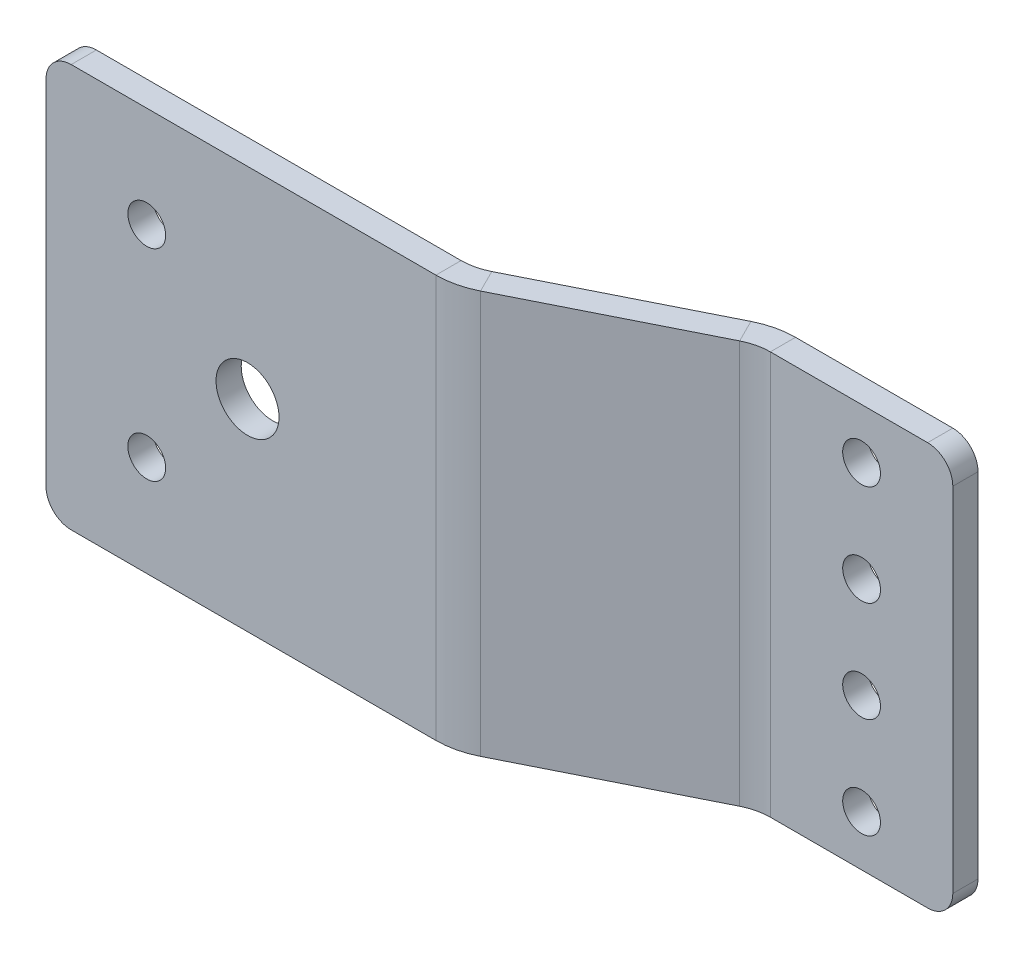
ISO-10303-21;
HEADER;
FILE_DESCRIPTION(('STEP AP214'),'2;1');
FILE_NAME('part.step','',(''),(''),'','','');
FILE_SCHEMA(('AUTOMOTIVE_DESIGN { 1 0 10303 214 1 1 1 1 }'));
ENDSEC;
DATA;
#1=APPLICATION_CONTEXT('core data for automotive mechanical design processes');
#2=APPLICATION_PROTOCOL_DEFINITION('international standard','automotive_design',2000,#1);
#3=PRODUCT_CONTEXT('',#1,'mechanical');
#4=PRODUCT('Part','Part','',(#3));
#5=PRODUCT_RELATED_PRODUCT_CATEGORY('part','',(#4));
#6=PRODUCT_DEFINITION_FORMATION('','',#4);
#7=PRODUCT_DEFINITION_CONTEXT('part definition',#1,'design');
#8=PRODUCT_DEFINITION('design','',#6,#7);
#9=PRODUCT_DEFINITION_SHAPE('','',#8);
#10=(LENGTH_UNIT() NAMED_UNIT(*) SI_UNIT(.MILLI.,.METRE.));
#11=(NAMED_UNIT(*) PLANE_ANGLE_UNIT() SI_UNIT($,.RADIAN.));
#12=(NAMED_UNIT(*) SI_UNIT($,.STERADIAN.) SOLID_ANGLE_UNIT());
#13=UNCERTAINTY_MEASURE_WITH_UNIT(LENGTH_MEASURE(1.E-05),#10,'distance_accuracy_value','');
#14=(GEOMETRIC_REPRESENTATION_CONTEXT(3) GLOBAL_UNCERTAINTY_ASSIGNED_CONTEXT((#13)) GLOBAL_UNIT_ASSIGNED_CONTEXT((#10,
#11,#12)) REPRESENTATION_CONTEXT('',''));
#15=CARTESIAN_POINT('',(0.,0.,0.));
#16=DIRECTION('',(0.,0.,1.));
#17=DIRECTION('',(1.,0.,0.));
#18=AXIS2_PLACEMENT_3D('',#15,#16,#17);
#19=CARTESIAN_POINT('',(1.47801932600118,50.8,-0.739009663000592));
#20=DIRECTION('',(0.,1.,0.));
#21=DIRECTION('',(0.,0.,1.));
#22=AXIS2_PLACEMENT_3D('',#19,#20,#21);
#23=PLANE('',#22);
#24=DIRECTION('',(0.447213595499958,0.,0.894427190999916));
#25=VECTOR('',#24,1.);
#26=CARTESIAN_POINT('',(1.47801932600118,50.8,-0.739009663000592));
#27=LINE('',#26,#25);
#28=CARTESIAN_POINT('',(1.47801932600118,50.8,-0.739009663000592));
#29=VERTEX_POINT('',#28);
#30=CARTESIAN_POINT('',(2.89792249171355,50.8,2.10079666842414));
#31=VERTEX_POINT('',#30);
#32=EDGE_CURVE('E274',#29,#31,#27,.T.);
#33=ORIENTED_EDGE('',*,*,#32,.F.);
#34=CARTESIAN_POINT('',(-1.65247584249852,50.8,-7.));
#35=DIRECTION('',(0.,-1.,0.));
#36=DIRECTION('',(0.,0.,-1.));
#37=AXIS2_PLACEMENT_3D('',#34,#35,#36);
#38=CIRCLE('',#37,7.);
#39=CARTESIAN_POINT('',(-1.65247584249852,50.8,0.));
#40=VERTEX_POINT('',#39);
#41=EDGE_CURVE('E191',#40,#29,#38,.F.);
#42=ORIENTED_EDGE('',*,*,#41,.F.);
#43=DIRECTION('',(0.,0.,-1.));
#44=VECTOR('',#43,1.);
#45=CARTESIAN_POINT('',(-1.65247584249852,50.8,3.175));
#46=LINE('',#45,#44);
#47=CARTESIAN_POINT('',(-1.65247584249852,50.8,3.175));
#48=VERTEX_POINT('',#47);
#49=EDGE_CURVE('E271',#48,#40,#46,.T.);
#50=ORIENTED_EDGE('',*,*,#49,.F.);
#51=CARTESIAN_POINT('',(-1.65247584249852,50.8,-7.));
#52=DIRECTION('',(0.,1.,0.));
#53=DIRECTION('',(1.,0.,0.));
#54=AXIS2_PLACEMENT_3D('',#51,#52,#53);
#55=CIRCLE('',#54,10.175);
#56=EDGE_CURVE('E201',#48,#31,#55,.T.);
#57=ORIENTED_EDGE('',*,*,#56,.T.);
#58=EDGE_LOOP('',(#33,#42,#50,#57));
#59=FACE_BOUND('',#58,.T.);
#60=ADVANCED_FACE('F36',(#59),#23,.T.);
#61=CARTESIAN_POINT('',(-1.65247584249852,50.8,3.175));
#62=DIRECTION('',(0.,1.,0.));
#63=DIRECTION('',(0.,0.,1.));
#64=AXIS2_PLACEMENT_3D('',#61,#62,#63);
#65=PLANE('',#64);
#66=DIRECTION('',(0.894427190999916,0.,-0.447213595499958));
#67=VECTOR('',#66,1.);
#68=CARTESIAN_POINT('',(0.,50.8,0.));
#69=LINE('',#68,#67);
#70=CARTESIAN_POINT('',(23.2515933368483,50.8,-11.6257966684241));
#71=VERTEX_POINT('',#70);
#72=EDGE_CURVE('E189',#29,#71,#69,.T.);
#73=ORIENTED_EDGE('',*,*,#72,.F.);
#74=ORIENTED_EDGE('',*,*,#32,.T.);
#75=DIRECTION('',(0.894427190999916,0.,-0.447213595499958));
#76=VECTOR('',#75,1.);
#77=CARTESIAN_POINT('',(1.41990316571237,50.8,2.83980633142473));
#78=LINE('',#77,#76);
#79=CARTESIAN_POINT('',(24.6714965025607,50.8,-8.78599033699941));
#80=VERTEX_POINT('',#79);
#81=EDGE_CURVE('E204',#31,#80,#78,.T.);
#82=ORIENTED_EDGE('',*,*,#81,.T.);
#83=DIRECTION('',(-0.447213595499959,0.,-0.894427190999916));
#84=VECTOR('',#83,1.);
#85=CARTESIAN_POINT('',(24.6714965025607,50.8,-8.78599033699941));
#86=LINE('',#85,#84);
#87=EDGE_CURVE('E163',#80,#71,#86,.T.);
#88=ORIENTED_EDGE('',*,*,#87,.T.);
#89=EDGE_LOOP('',(#73,#74,#82,#88));
#90=FACE_BOUND('',#89,.T.);
#91=ADVANCED_FACE('F340',(#90),#65,.T.);
#92=CARTESIAN_POINT('',(-1.65247584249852,0.,0.));
#93=DIRECTION('',(0.,-1.,0.));
#94=DIRECTION('',(0.,0.,-1.));
#95=AXIS2_PLACEMENT_3D('',#92,#93,#94);
#96=PLANE('',#95);
#97=DIRECTION('',(0.,0.,1.));
#98=VECTOR('',#97,1.);
#99=CARTESIAN_POINT('',(-1.65247584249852,0.,0.));
#100=LINE('',#99,#98);
#101=CARTESIAN_POINT('',(-1.65247584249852,0.,0.));
#102=VERTEX_POINT('',#101);
#103=CARTESIAN_POINT('',(-1.65247584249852,0.,3.175));
#104=VERTEX_POINT('',#103);
#105=EDGE_CURVE('E268',#102,#104,#100,.T.);
#106=ORIENTED_EDGE('',*,*,#105,.F.);
#107=CARTESIAN_POINT('',(-1.65247584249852,0.,-7.));
#108=DIRECTION('',(0.,-1.,0.));
#109=DIRECTION('',(0.,0.,-1.));
#110=AXIS2_PLACEMENT_3D('',#107,#108,#109);
#111=CIRCLE('',#110,7.);
#112=CARTESIAN_POINT('',(1.47801932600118,0.,-0.739009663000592));
#113=VERTEX_POINT('',#112);
#114=EDGE_CURVE('E219',#102,#113,#111,.F.);
#115=ORIENTED_EDGE('',*,*,#114,.T.);
#116=DIRECTION('',(-0.447213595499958,0.,-0.894427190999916));
#117=VECTOR('',#116,1.);
#118=CARTESIAN_POINT('',(2.89792249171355,0.,2.10079666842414));
#119=LINE('',#118,#117);
#120=CARTESIAN_POINT('',(2.89792249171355,0.,2.10079666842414));
#121=VERTEX_POINT('',#120);
#122=EDGE_CURVE('E162',#121,#113,#119,.T.);
#123=ORIENTED_EDGE('',*,*,#122,.F.);
#124=CARTESIAN_POINT('',(-1.65247584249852,0.,-7.));
#125=DIRECTION('',(0.,1.,0.));
#126=DIRECTION('',(1.,0.,0.));
#127=AXIS2_PLACEMENT_3D('',#124,#125,#126);
#128=CIRCLE('',#127,10.175);
#129=EDGE_CURVE('E226',#104,#121,#128,.T.);
#130=ORIENTED_EDGE('',*,*,#129,.F.);
#131=EDGE_LOOP('',(#106,#115,#123,#130));
#132=FACE_BOUND('',#131,.T.);
#133=ADVANCED_FACE('F427',(#132),#96,.T.);
#134=CARTESIAN_POINT('',(2.89792249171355,0.,2.10079666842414));
#135=DIRECTION('',(0.,-1.,0.));
#136=DIRECTION('',(0.,0.,-1.));
#137=AXIS2_PLACEMENT_3D('',#134,#135,#136);
#138=PLANE('',#137);
#139=DIRECTION('',(1.,0.,0.));
#140=VECTOR('',#139,1.);
#141=CARTESIAN_POINT('',(-50.8,0.,3.175));
#142=LINE('',#141,#140);
#143=CARTESIAN_POINT('',(-47.625,0.,3.175));
#144=VERTEX_POINT('',#143);
#145=EDGE_CURVE('E224',#144,#104,#142,.T.);
#146=ORIENTED_EDGE('',*,*,#145,.F.);
#147=DIRECTION('',(0.,0.,-1.));
#148=VECTOR('',#147,1.);
#149=CARTESIAN_POINT('',(-47.625,0.,2.10079666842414));
#150=LINE('',#149,#148);
#151=CARTESIAN_POINT('',(-47.625,0.,0.));
#152=VERTEX_POINT('',#151);
#153=EDGE_CURVE('E293',#144,#152,#150,.T.);
#154=ORIENTED_EDGE('',*,*,#153,.T.);
#155=DIRECTION('',(1.,0.,0.));
#156=VECTOR('',#155,1.);
#157=CARTESIAN_POINT('',(-50.8,0.,0.));
#158=LINE('',#157,#156);
#159=EDGE_CURVE('E222',#152,#102,#158,.T.);
#160=ORIENTED_EDGE('',*,*,#159,.T.);
#161=ORIENTED_EDGE('',*,*,#105,.T.);
#162=EDGE_LOOP('',(#146,#154,#160,#161));
#163=FACE_BOUND('',#162,.T.);
#164=ADVANCED_FACE('F313',(#163),#138,.T.);
#165=CARTESIAN_POINT('',(27.8019916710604,50.8,-12.7));
#166=DIRECTION('',(0.,1.,0.));
#167=DIRECTION('',(0.,0.,1.));
#168=AXIS2_PLACEMENT_3D('',#165,#166,#167);
#169=PLANE('',#168);
#170=DIRECTION('',(0.,0.,1.));
#171=VECTOR('',#170,1.);
#172=CARTESIAN_POINT('',(27.8019916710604,50.8,-12.7));
#173=LINE('',#172,#171);
#174=CARTESIAN_POINT('',(27.8019916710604,50.8,-12.7));
#175=VERTEX_POINT('',#174);
#176=CARTESIAN_POINT('',(27.8019916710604,50.8,-9.525));
#177=VERTEX_POINT('',#176);
#178=EDGE_CURVE('E150',#175,#177,#173,.T.);
#179=ORIENTED_EDGE('',*,*,#178,.F.);
#180=CARTESIAN_POINT('',(27.8019916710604,50.8,-2.525));
#181=DIRECTION('',(0.,1.,0.));
#182=DIRECTION('',(0.,0.,1.));
#183=AXIS2_PLACEMENT_3D('',#180,#181,#182);
#184=CIRCLE('',#183,10.175);
#185=EDGE_CURVE('E154',#71,#175,#184,.F.);
#186=ORIENTED_EDGE('',*,*,#185,.F.);
#187=ORIENTED_EDGE('',*,*,#87,.F.);
#188=CARTESIAN_POINT('',(27.8019916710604,50.8,-2.525));
#189=DIRECTION('',(0.,1.,0.));
#190=DIRECTION('',(1.,0.,0.));
#191=AXIS2_PLACEMENT_3D('',#188,#189,#190);
#192=CIRCLE('',#191,7.);
#193=EDGE_CURVE('E157',#80,#177,#192,.F.);
#194=ORIENTED_EDGE('',*,*,#193,.T.);
#195=EDGE_LOOP('',(#179,#186,#187,#194));
#196=FACE_BOUND('',#195,.T.);
#197=ADVANCED_FACE('F152',(#196),#169,.T.);
#198=CARTESIAN_POINT('',(24.6714965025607,50.8,-8.78599033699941));
#199=DIRECTION('',(0.,1.,0.));
#200=DIRECTION('',(0.,0.,1.));
#201=AXIS2_PLACEMENT_3D('',#198,#199,#200);
#202=PLANE('',#201);
#203=DIRECTION('',(1.,0.,0.));
#204=VECTOR('',#203,1.);
#205=CARTESIAN_POINT('',(25.4,50.8,-9.525));
#206=LINE('',#205,#204);
#207=CARTESIAN_POINT('',(47.625,50.8,-9.525));
#208=VERTEX_POINT('',#207);
#209=EDGE_CURVE('E184',#177,#208,#206,.T.);
#210=ORIENTED_EDGE('',*,*,#209,.T.);
#211=DIRECTION('',(0.,0.,1.));
#212=VECTOR('',#211,1.);
#213=CARTESIAN_POINT('',(47.625,50.8,-8.78599033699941));
#214=LINE('',#213,#212);
#215=CARTESIAN_POINT('',(47.625,50.8,-12.7));
#216=VERTEX_POINT('',#215);
#217=EDGE_CURVE('E183',#208,#216,#214,.F.);
#218=ORIENTED_EDGE('',*,*,#217,.T.);
#219=DIRECTION('',(1.,0.,0.));
#220=VECTOR('',#219,1.);
#221=CARTESIAN_POINT('',(25.4,50.8,-12.7));
#222=LINE('',#221,#220);
#223=EDGE_CURVE('E171',#175,#216,#222,.T.);
#224=ORIENTED_EDGE('',*,*,#223,.F.);
#225=ORIENTED_EDGE('',*,*,#178,.T.);
#226=EDGE_LOOP('',(#210,#218,#224,#225));
#227=FACE_BOUND('',#226,.T.);
#228=ADVANCED_FACE('F181',(#227),#202,.T.);
#229=CARTESIAN_POINT('',(23.2515933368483,0.,-11.6257966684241));
#230=DIRECTION('',(0.,-1.,0.));
#231=DIRECTION('',(0.,0.,-1.));
#232=AXIS2_PLACEMENT_3D('',#229,#230,#231);
#233=PLANE('',#232);
#234=DIRECTION('',(0.447213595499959,0.,0.894427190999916));
#235=VECTOR('',#234,1.);
#236=CARTESIAN_POINT('',(23.2515933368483,0.,-11.6257966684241));
#237=LINE('',#236,#235);
#238=CARTESIAN_POINT('',(23.2515933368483,0.,-11.6257966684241));
#239=VERTEX_POINT('',#238);
#240=CARTESIAN_POINT('',(24.6714965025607,0.,-8.78599033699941));
#241=VERTEX_POINT('',#240);
#242=EDGE_CURVE('E264',#239,#241,#237,.T.);
#243=ORIENTED_EDGE('',*,*,#242,.F.);
#244=CARTESIAN_POINT('',(27.8019916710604,0.,-2.525));
#245=DIRECTION('',(0.,1.,0.));
#246=DIRECTION('',(0.,0.,1.));
#247=AXIS2_PLACEMENT_3D('',#244,#245,#246);
#248=CIRCLE('',#247,10.175);
#249=CARTESIAN_POINT('',(27.8019916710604,0.,-12.7));
#250=VERTEX_POINT('',#249);
#251=EDGE_CURVE('E214',#239,#250,#248,.F.);
#252=ORIENTED_EDGE('',*,*,#251,.T.);
#253=DIRECTION('',(0.,0.,-1.));
#254=VECTOR('',#253,1.);
#255=CARTESIAN_POINT('',(27.8019916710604,0.,-9.525));
#256=LINE('',#255,#254);
#257=CARTESIAN_POINT('',(27.8019916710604,0.,-9.525));
#258=VERTEX_POINT('',#257);
#259=EDGE_CURVE('E262',#258,#250,#256,.T.);
#260=ORIENTED_EDGE('',*,*,#259,.F.);
#261=CARTESIAN_POINT('',(27.8019916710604,0.,-2.525));
#262=DIRECTION('',(0.,1.,0.));
#263=DIRECTION('',(1.,0.,0.));
#264=AXIS2_PLACEMENT_3D('',#261,#262,#263);
#265=CIRCLE('',#264,7.);
#266=EDGE_CURVE('E232',#241,#258,#265,.F.);
#267=ORIENTED_EDGE('',*,*,#266,.F.);
#268=EDGE_LOOP('',(#243,#252,#260,#267));
#269=FACE_BOUND('',#268,.T.);
#270=ADVANCED_FACE('F562',(#269),#233,.T.);
#271=CARTESIAN_POINT('',(27.8019916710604,0.,-9.525));
#272=DIRECTION('',(0.,-1.,0.));
#273=DIRECTION('',(0.,0.,-1.));
#274=AXIS2_PLACEMENT_3D('',#271,#272,#273);
#275=PLANE('',#274);
#276=DIRECTION('',(0.894427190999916,0.,-0.447213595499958));
#277=VECTOR('',#276,1.);
#278=CARTESIAN_POINT('',(0.,0.,0.));
#279=LINE('',#278,#277);
#280=EDGE_CURVE('E216',#113,#239,#279,.T.);
#281=ORIENTED_EDGE('',*,*,#280,.T.);
#282=ORIENTED_EDGE('',*,*,#242,.T.);
#283=DIRECTION('',(0.894427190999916,0.,-0.447213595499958));
#284=VECTOR('',#283,1.);
#285=CARTESIAN_POINT('',(1.41990316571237,0.,2.83980633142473));
#286=LINE('',#285,#284);
#287=EDGE_CURVE('E229',#121,#241,#286,.T.);
#288=ORIENTED_EDGE('',*,*,#287,.F.);
#289=ORIENTED_EDGE('',*,*,#122,.T.);
#290=EDGE_LOOP('',(#281,#282,#288,#289));
#291=FACE_BOUND('',#290,.T.);
#292=ADVANCED_FACE('F549',(#291),#275,.T.);
#293=CARTESIAN_POINT('',(25.4,50.8,-9.525));
#294=DIRECTION('',(0.,0.,-1.));
#295=DIRECTION('',(-1.,0.,0.));
#296=AXIS2_PLACEMENT_3D('',#293,#294,#295);
#297=PLANE('',#296);
#298=CARTESIAN_POINT('',(39.3009958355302,6.35,-9.525));
#299=DIRECTION('',(0.,0.,1.));
#300=DIRECTION('',(1.,0.,0.));
#301=AXIS2_PLACEMENT_3D('',#298,#299,#300);
#302=CIRCLE('',#301,2.38125);
#303=CARTESIAN_POINT('',(41.6822458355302,6.35,-9.525));
#304=VERTEX_POINT('',#303);
#305=EDGE_CURVE('E373',#304,#304,#302,.T.);
#306=ORIENTED_EDGE('',*,*,#305,.F.);
#307=EDGE_LOOP('',(#306));
#308=FACE_BOUND('',#307,.T.);
#309=CARTESIAN_POINT('',(39.3009958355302,19.05,-9.525));
#310=DIRECTION('',(0.,0.,1.));
#311=DIRECTION('',(1.,0.,0.));
#312=AXIS2_PLACEMENT_3D('',#309,#310,#311);
#313=CIRCLE('',#312,2.38125);
#314=CARTESIAN_POINT('',(41.6822458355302,19.05,-9.525));
#315=VERTEX_POINT('',#314);
#316=EDGE_CURVE('E367',#315,#315,#313,.T.);
#317=ORIENTED_EDGE('',*,*,#316,.F.);
#318=EDGE_LOOP('',(#317));
#319=FACE_BOUND('',#318,.T.);
#320=CARTESIAN_POINT('',(39.3009958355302,31.75,-9.525));
#321=DIRECTION('',(0.,0.,1.));
#322=DIRECTION('',(1.,0.,0.));
#323=AXIS2_PLACEMENT_3D('',#320,#321,#322);
#324=CIRCLE('',#323,2.38125);
#325=CARTESIAN_POINT('',(41.6822458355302,31.75,-9.525));
#326=VERTEX_POINT('',#325);
#327=EDGE_CURVE('E361',#326,#326,#324,.T.);
#328=ORIENTED_EDGE('',*,*,#327,.F.);
#329=EDGE_LOOP('',(#328));
#330=FACE_BOUND('',#329,.T.);
#331=CARTESIAN_POINT('',(39.3009958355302,44.45,-9.525));
#332=DIRECTION('',(0.,0.,1.));
#333=DIRECTION('',(1.,0.,0.));
#334=AXIS2_PLACEMENT_3D('',#331,#332,#333);
#335=CIRCLE('',#334,2.38125);
#336=CARTESIAN_POINT('',(41.6822458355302,44.45,-9.525));
#337=VERTEX_POINT('',#336);
#338=EDGE_CURVE('E355',#337,#337,#335,.T.);
#339=ORIENTED_EDGE('',*,*,#338,.F.);
#340=EDGE_LOOP('',(#339));
#341=FACE_BOUND('',#340,.T.);
#342=DIRECTION('',(0.,-1.,0.));
#343=VECTOR('',#342,1.);
#344=CARTESIAN_POINT('',(50.8,50.8,-9.525));
#345=LINE('',#344,#343);
#346=CARTESIAN_POINT('',(50.8,47.625,-9.525));
#347=VERTEX_POINT('',#346);
#348=CARTESIAN_POINT('',(50.8,3.175,-9.525));
#349=VERTEX_POINT('',#348);
#350=EDGE_CURVE('E259',#347,#349,#345,.T.);
#351=ORIENTED_EDGE('',*,*,#350,.F.);
#352=CARTESIAN_POINT('',(47.625,47.625,-9.525));
#353=DIRECTION('',(0.,0.,-1.));
#354=DIRECTION('',(-1.,0.,0.));
#355=AXIS2_PLACEMENT_3D('',#352,#353,#354);
#356=CIRCLE('',#355,3.175);
#357=EDGE_CURVE('E283',#347,#208,#356,.F.);
#358=ORIENTED_EDGE('',*,*,#357,.T.);
#359=ORIENTED_EDGE('',*,*,#209,.F.);
#360=DIRECTION('',(0.,-1.,0.));
#361=VECTOR('',#360,1.);
#362=CARTESIAN_POINT('',(27.8019916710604,50.8,-9.525));
#363=LINE('',#362,#361);
#364=EDGE_CURVE('E208',#177,#258,#363,.T.);
#365=ORIENTED_EDGE('',*,*,#364,.T.);
#366=DIRECTION('',(1.,0.,0.));
#367=VECTOR('',#366,1.);
#368=CARTESIAN_POINT('',(25.4,0.,-9.525));
#369=LINE('',#368,#367);
#370=CARTESIAN_POINT('',(47.625,0.,-9.525));
#371=VERTEX_POINT('',#370);
#372=EDGE_CURVE('E209',#258,#371,#369,.T.);
#373=ORIENTED_EDGE('',*,*,#372,.T.);
#374=CARTESIAN_POINT('',(47.625,3.175,-9.525));
#375=DIRECTION('',(0.,0.,-1.));
#376=DIRECTION('',(-1.,0.,0.));
#377=AXIS2_PLACEMENT_3D('',#374,#375,#376);
#378=CIRCLE('',#377,3.175);
#379=EDGE_CURVE('E281',#371,#349,#378,.F.);
#380=ORIENTED_EDGE('',*,*,#379,.T.);
#381=EDGE_LOOP('',(#351,#358,#359,#365,#373,#380));
#382=FACE_BOUND('',#381,.T.);
#383=ADVANCED_FACE('F353',(#308,#319,#330,#341,#382),#297,.F.);
#384=CARTESIAN_POINT('',(50.8,50.8,-12.7));
#385=DIRECTION('',(1.,0.,0.));
#386=DIRECTION('',(0.,0.,-1.));
#387=AXIS2_PLACEMENT_3D('',#384,#385,#386);
#388=PLANE('',#387);
#389=DIRECTION('',(0.,-1.,0.));
#390=VECTOR('',#389,1.);
#391=CARTESIAN_POINT('',(50.8,50.8,-12.7));
#392=LINE('',#391,#390);
#393=CARTESIAN_POINT('',(50.8,47.625,-12.7));
#394=VERTEX_POINT('',#393);
#395=CARTESIAN_POINT('',(50.8,3.175,-12.7));
#396=VERTEX_POINT('',#395);
#397=EDGE_CURVE('E178',#394,#396,#392,.T.);
#398=ORIENTED_EDGE('',*,*,#397,.F.);
#399=DIRECTION('',(0.,0.,1.));
#400=VECTOR('',#399,1.);
#401=CARTESIAN_POINT('',(50.8,47.625,-12.7));
#402=LINE('',#401,#400);
#403=EDGE_CURVE('E278',#394,#347,#402,.T.);
#404=ORIENTED_EDGE('',*,*,#403,.T.);
#405=ORIENTED_EDGE('',*,*,#350,.T.);
#406=DIRECTION('',(0.,0.,1.));
#407=VECTOR('',#406,1.);
#408=CARTESIAN_POINT('',(50.8,3.175,-12.7));
#409=LINE('',#408,#407);
#410=EDGE_CURVE('E276',#349,#396,#409,.F.);
#411=ORIENTED_EDGE('',*,*,#410,.T.);
#412=EDGE_LOOP('',(#398,#404,#405,#411));
#413=FACE_BOUND('',#412,.T.);
#414=ADVANCED_FACE('F526',(#413),#388,.T.);
#415=CARTESIAN_POINT('',(25.4,50.8,-12.7));
#416=DIRECTION('',(0.,0.,-1.));
#417=DIRECTION('',(-1.,0.,0.));
#418=AXIS2_PLACEMENT_3D('',#415,#416,#417);
#419=PLANE('',#418);
#420=CARTESIAN_POINT('',(39.3009958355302,6.35,-12.7));
#421=DIRECTION('',(0.,0.,1.));
#422=DIRECTION('',(1.,0.,0.));
#423=AXIS2_PLACEMENT_3D('',#420,#421,#422);
#424=CIRCLE('',#423,2.38125);
#425=CARTESIAN_POINT('',(41.6822458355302,6.35,-12.7));
#426=VERTEX_POINT('',#425);
#427=EDGE_CURVE('E370',#426,#426,#424,.T.);
#428=ORIENTED_EDGE('',*,*,#427,.T.);
#429=EDGE_LOOP('',(#428));
#430=FACE_BOUND('',#429,.T.);
#431=CARTESIAN_POINT('',(39.3009958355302,19.05,-12.7));
#432=DIRECTION('',(0.,0.,1.));
#433=DIRECTION('',(1.,0.,0.));
#434=AXIS2_PLACEMENT_3D('',#431,#432,#433);
#435=CIRCLE('',#434,2.38125);
#436=CARTESIAN_POINT('',(41.6822458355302,19.05,-12.7));
#437=VERTEX_POINT('',#436);
#438=EDGE_CURVE('E364',#437,#437,#435,.T.);
#439=ORIENTED_EDGE('',*,*,#438,.T.);
#440=EDGE_LOOP('',(#439));
#441=FACE_BOUND('',#440,.T.);
#442=CARTESIAN_POINT('',(39.3009958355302,31.75,-12.7));
#443=DIRECTION('',(0.,0.,1.));
#444=DIRECTION('',(1.,0.,0.));
#445=AXIS2_PLACEMENT_3D('',#442,#443,#444);
#446=CIRCLE('',#445,2.38125);
#447=CARTESIAN_POINT('',(41.6822458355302,31.75,-12.7));
#448=VERTEX_POINT('',#447);
#449=EDGE_CURVE('E358',#448,#448,#446,.T.);
#450=ORIENTED_EDGE('',*,*,#449,.T.);
#451=EDGE_LOOP('',(#450));
#452=FACE_BOUND('',#451,.T.);
#453=CARTESIAN_POINT('',(39.3009958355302,44.45,-12.7));
#454=DIRECTION('',(0.,0.,1.));
#455=DIRECTION('',(1.,0.,0.));
#456=AXIS2_PLACEMENT_3D('',#453,#454,#455);
#457=CIRCLE('',#456,2.38125);
#458=CARTESIAN_POINT('',(41.6822458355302,44.45,-12.7));
#459=VERTEX_POINT('',#458);
#460=EDGE_CURVE('E212',#459,#459,#457,.T.);
#461=ORIENTED_EDGE('',*,*,#460,.T.);
#462=EDGE_LOOP('',(#461));
#463=FACE_BOUND('',#462,.T.);
#464=ORIENTED_EDGE('',*,*,#223,.T.);
#465=CARTESIAN_POINT('',(47.625,47.625,-12.7));
#466=DIRECTION('',(0.,0.,-1.));
#467=DIRECTION('',(-1.,0.,0.));
#468=AXIS2_PLACEMENT_3D('',#465,#466,#467);
#469=CIRCLE('',#468,3.175);
#470=EDGE_CURVE('E288',#216,#394,#469,.T.);
#471=ORIENTED_EDGE('',*,*,#470,.T.);
#472=ORIENTED_EDGE('',*,*,#397,.T.);
#473=CARTESIAN_POINT('',(47.625,3.175,-12.7));
#474=DIRECTION('',(0.,0.,-1.));
#475=DIRECTION('',(-1.,0.,0.));
#476=AXIS2_PLACEMENT_3D('',#473,#474,#475);
#477=CIRCLE('',#476,3.175);
#478=CARTESIAN_POINT('',(47.625,0.,-12.7));
#479=VERTEX_POINT('',#478);
#480=EDGE_CURVE('E286',#396,#479,#477,.T.);
#481=ORIENTED_EDGE('',*,*,#480,.T.);
#482=DIRECTION('',(1.,0.,0.));
#483=VECTOR('',#482,1.);
#484=CARTESIAN_POINT('',(25.4,0.,-12.7));
#485=LINE('',#484,#483);
#486=EDGE_CURVE('E174',#250,#479,#485,.T.);
#487=ORIENTED_EDGE('',*,*,#486,.F.);
#488=DIRECTION('',(0.,-1.,0.));
#489=VECTOR('',#488,1.);
#490=CARTESIAN_POINT('',(27.8019916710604,50.8,-12.7));
#491=LINE('',#490,#489);
#492=EDGE_CURVE('E169',#175,#250,#491,.T.);
#493=ORIENTED_EDGE('',*,*,#492,.F.);
#494=EDGE_LOOP('',(#464,#471,#472,#481,#487,#493));
#495=FACE_BOUND('',#494,.T.);
#496=ADVANCED_FACE('F170',(#430,#441,#452,#463,#495),#419,.T.);
#497=CARTESIAN_POINT('',(27.8019916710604,50.8,-2.525));
#498=DIRECTION('',(0.,-1.,0.));
#499=DIRECTION('',(0.,0.,-1.));
#500=AXIS2_PLACEMENT_3D('',#497,#498,#499);
#501=CYLINDRICAL_SURFACE('',#500,10.175);
#502=ORIENTED_EDGE('',*,*,#251,.F.);
#503=DIRECTION('',(0.,-1.,0.));
#504=VECTOR('',#503,1.);
#505=CARTESIAN_POINT('',(23.2515933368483,50.8,-11.6257966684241));
#506=LINE('',#505,#504);
#507=EDGE_CURVE('E179',#71,#239,#506,.T.);
#508=ORIENTED_EDGE('',*,*,#507,.F.);
#509=ORIENTED_EDGE('',*,*,#185,.T.);
#510=ORIENTED_EDGE('',*,*,#492,.T.);
#511=EDGE_LOOP('',(#502,#508,#509,#510));
#512=FACE_BOUND('',#511,.T.);
#513=ADVANCED_FACE('F187',(#512),#501,.T.);
#514=CARTESIAN_POINT('',(0.,50.8,0.));
#515=DIRECTION('',(-0.447213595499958,0.,-0.894427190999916));
#516=DIRECTION('',(-0.894427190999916,0.,0.447213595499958));
#517=AXIS2_PLACEMENT_3D('',#514,#515,#516);
#518=PLANE('',#517);
#519=ORIENTED_EDGE('',*,*,#280,.F.);
#520=DIRECTION('',(0.,-1.,0.));
#521=VECTOR('',#520,1.);
#522=CARTESIAN_POINT('',(1.47801932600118,50.8,-0.739009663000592));
#523=LINE('',#522,#521);
#524=EDGE_CURVE('E253',#29,#113,#523,.T.);
#525=ORIENTED_EDGE('',*,*,#524,.F.);
#526=ORIENTED_EDGE('',*,*,#72,.T.);
#527=ORIENTED_EDGE('',*,*,#507,.T.);
#528=EDGE_LOOP('',(#519,#525,#526,#527));
#529=FACE_BOUND('',#528,.T.);
#530=ADVANCED_FACE('F339',(#529),#518,.T.);
#531=CARTESIAN_POINT('',(-1.65247584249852,50.8,-7.));
#532=DIRECTION('',(0.,-1.,0.));
#533=DIRECTION('',(0.,0.,-1.));
#534=AXIS2_PLACEMENT_3D('',#531,#532,#533);
#535=CYLINDRICAL_SURFACE('',#534,7.);
#536=ORIENTED_EDGE('',*,*,#114,.F.);
#537=DIRECTION('',(0.,-1.,0.));
#538=VECTOR('',#537,1.);
#539=CARTESIAN_POINT('',(-1.65247584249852,50.8,0.));
#540=LINE('',#539,#538);
#541=EDGE_CURVE('E250',#40,#102,#540,.T.);
#542=ORIENTED_EDGE('',*,*,#541,.F.);
#543=ORIENTED_EDGE('',*,*,#41,.T.);
#544=ORIENTED_EDGE('',*,*,#524,.T.);
#545=EDGE_LOOP('',(#536,#542,#543,#544));
#546=FACE_BOUND('',#545,.T.);
#547=ADVANCED_FACE('F331',(#546),#535,.F.);
#548=CARTESIAN_POINT('',(-50.8,50.8,0.));
#549=DIRECTION('',(0.,0.,-1.));
#550=DIRECTION('',(-1.,0.,0.));
#551=AXIS2_PLACEMENT_3D('',#548,#549,#550);
#552=PLANE('',#551);
#553=CARTESIAN_POINT('',(-25.4,25.4,0.));
#554=DIRECTION('',(0.,0.,-1.));
#555=DIRECTION('',(-1.,0.,0.));
#556=AXIS2_PLACEMENT_3D('',#553,#554,#555);
#557=CIRCLE('',#556,3.96874999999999);
#558=CARTESIAN_POINT('',(-29.36875,25.4,0.));
#559=VERTEX_POINT('',#558);
#560=EDGE_CURVE('E390',#559,#559,#557,.T.);
#561=ORIENTED_EDGE('',*,*,#560,.F.);
#562=EDGE_LOOP('',(#561));
#563=FACE_BOUND('',#562,.T.);
#564=CARTESIAN_POINT('',(-38.1,12.7,0.));
#565=DIRECTION('',(0.,0.,-1.));
#566=DIRECTION('',(-1.,0.,0.));
#567=AXIS2_PLACEMENT_3D('',#564,#565,#566);
#568=CIRCLE('',#567,2.38125);
#569=CARTESIAN_POINT('',(-40.48125,12.7,0.));
#570=VERTEX_POINT('',#569);
#571=EDGE_CURVE('E384',#570,#570,#568,.T.);
#572=ORIENTED_EDGE('',*,*,#571,.F.);
#573=EDGE_LOOP('',(#572));
#574=FACE_BOUND('',#573,.T.);
#575=CARTESIAN_POINT('',(-38.1,38.1,0.));
#576=DIRECTION('',(0.,0.,-1.));
#577=DIRECTION('',(-1.,0.,0.));
#578=AXIS2_PLACEMENT_3D('',#575,#576,#577);
#579=CIRCLE('',#578,2.38125);
#580=CARTESIAN_POINT('',(-40.48125,38.1,0.));
#581=VERTEX_POINT('',#580);
#582=EDGE_CURVE('E376',#581,#581,#579,.T.);
#583=ORIENTED_EDGE('',*,*,#582,.F.);
#584=EDGE_LOOP('',(#583));
#585=FACE_BOUND('',#584,.T.);
#586=ORIENTED_EDGE('',*,*,#159,.F.);
#587=CARTESIAN_POINT('',(-47.625,3.175,0.));
#588=DIRECTION('',(0.,0.,-1.));
#589=DIRECTION('',(-1.,0.,0.));
#590=AXIS2_PLACEMENT_3D('',#587,#588,#589);
#591=CIRCLE('',#590,3.175);
#592=CARTESIAN_POINT('',(-50.8,3.175,0.));
#593=VERTEX_POINT('',#592);
#594=EDGE_CURVE('E298',#152,#593,#591,.T.);
#595=ORIENTED_EDGE('',*,*,#594,.T.);
#596=DIRECTION('',(0.,-1.,0.));
#597=VECTOR('',#596,1.);
#598=CARTESIAN_POINT('',(-50.8,50.8,0.));
#599=LINE('',#598,#597);
#600=CARTESIAN_POINT('',(-50.8,47.625,0.));
#601=VERTEX_POINT('',#600);
#602=EDGE_CURVE('E248',#601,#593,#599,.T.);
#603=ORIENTED_EDGE('',*,*,#602,.F.);
#604=CARTESIAN_POINT('',(-47.625,47.625,0.));
#605=DIRECTION('',(0.,0.,-1.));
#606=DIRECTION('',(-1.,0.,0.));
#607=AXIS2_PLACEMENT_3D('',#604,#605,#606);
#608=CIRCLE('',#607,3.175);
#609=CARTESIAN_POINT('',(-47.625,50.8,0.));
#610=VERTEX_POINT('',#609);
#611=EDGE_CURVE('E296',#601,#610,#608,.T.);
#612=ORIENTED_EDGE('',*,*,#611,.T.);
#613=DIRECTION('',(1.,0.,0.));
#614=VECTOR('',#613,1.);
#615=CARTESIAN_POINT('',(-50.8,50.8,0.));
#616=LINE('',#615,#614);
#617=EDGE_CURVE('E197',#610,#40,#616,.T.);
#618=ORIENTED_EDGE('',*,*,#617,.T.);
#619=ORIENTED_EDGE('',*,*,#541,.T.);
#620=EDGE_LOOP('',(#586,#595,#603,#612,#618,#619));
#621=FACE_BOUND('',#620,.T.);
#622=ADVANCED_FACE('F319',(#563,#574,#585,#621),#552,.T.);
#623=CARTESIAN_POINT('',(-50.8,50.8,3.175));
#624=DIRECTION('',(-1.,0.,0.));
#625=DIRECTION('',(0.,0.,1.));
#626=AXIS2_PLACEMENT_3D('',#623,#624,#625);
#627=PLANE('',#626);
#628=ORIENTED_EDGE('',*,*,#602,.T.);
#629=DIRECTION('',(0.,0.,-1.));
#630=VECTOR('',#629,1.);
#631=CARTESIAN_POINT('',(-50.8,3.175,3.175));
#632=LINE('',#631,#630);
#633=CARTESIAN_POINT('',(-50.8,3.175,3.175));
#634=VERTEX_POINT('',#633);
#635=EDGE_CURVE('E57',#593,#634,#632,.F.);
#636=ORIENTED_EDGE('',*,*,#635,.T.);
#637=DIRECTION('',(0.,-1.,0.));
#638=VECTOR('',#637,1.);
#639=CARTESIAN_POINT('',(-50.8,50.8,3.175));
#640=LINE('',#639,#638);
#641=CARTESIAN_POINT('',(-50.8,47.625,3.175));
#642=VERTEX_POINT('',#641);
#643=EDGE_CURVE('E246',#642,#634,#640,.T.);
#644=ORIENTED_EDGE('',*,*,#643,.F.);
#645=DIRECTION('',(0.,0.,-1.));
#646=VECTOR('',#645,1.);
#647=CARTESIAN_POINT('',(-50.8,47.625,3.175));
#648=LINE('',#647,#646);
#649=EDGE_CURVE('E300',#642,#601,#648,.T.);
#650=ORIENTED_EDGE('',*,*,#649,.T.);
#651=EDGE_LOOP('',(#628,#636,#644,#650));
#652=FACE_BOUND('',#651,.T.);
#653=ADVANCED_FACE('F320',(#652),#627,.T.);
#654=CARTESIAN_POINT('',(-50.8,50.8,3.175));
#655=DIRECTION('',(0.,0.,-1.));
#656=DIRECTION('',(-1.,0.,0.));
#657=AXIS2_PLACEMENT_3D('',#654,#655,#656);
#658=PLANE('',#657);
#659=CARTESIAN_POINT('',(-25.4,25.4,3.175));
#660=DIRECTION('',(0.,0.,1.));
#661=DIRECTION('',(1.,0.,0.));
#662=AXIS2_PLACEMENT_3D('',#659,#660,#661);
#663=CIRCLE('',#662,3.96874999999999);
#664=CARTESIAN_POINT('',(-21.43125,25.4,3.175));
#665=VERTEX_POINT('',#664);
#666=EDGE_CURVE('E393',#665,#665,#663,.T.);
#667=ORIENTED_EDGE('',*,*,#666,.F.);
#668=EDGE_LOOP('',(#667));
#669=FACE_BOUND('',#668,.T.);
#670=CARTESIAN_POINT('',(-38.1,12.7,3.175));
#671=DIRECTION('',(0.,0.,1.));
#672=DIRECTION('',(1.,0.,0.));
#673=AXIS2_PLACEMENT_3D('',#670,#671,#672);
#674=CIRCLE('',#673,2.38125);
#675=CARTESIAN_POINT('',(-35.71875,12.7,3.175));
#676=VERTEX_POINT('',#675);
#677=EDGE_CURVE('E387',#676,#676,#674,.T.);
#678=ORIENTED_EDGE('',*,*,#677,.F.);
#679=EDGE_LOOP('',(#678));
#680=FACE_BOUND('',#679,.T.);
#681=CARTESIAN_POINT('',(-38.1,38.1,3.175));
#682=DIRECTION('',(0.,0.,1.));
#683=DIRECTION('',(1.,0.,0.));
#684=AXIS2_PLACEMENT_3D('',#681,#682,#683);
#685=CIRCLE('',#684,2.38125);
#686=CARTESIAN_POINT('',(-35.71875,38.1,3.175));
#687=VERTEX_POINT('',#686);
#688=EDGE_CURVE('E381',#687,#687,#685,.T.);
#689=ORIENTED_EDGE('',*,*,#688,.F.);
#690=EDGE_LOOP('',(#689));
#691=FACE_BOUND('',#690,.T.);
#692=ORIENTED_EDGE('',*,*,#643,.T.);
#693=CARTESIAN_POINT('',(-47.625,3.175,3.175));
#694=DIRECTION('',(0.,0.,-1.));
#695=DIRECTION('',(-1.,0.,0.));
#696=AXIS2_PLACEMENT_3D('',#693,#694,#695);
#697=CIRCLE('',#696,3.175);
#698=EDGE_CURVE('E44',#634,#144,#697,.F.);
#699=ORIENTED_EDGE('',*,*,#698,.T.);
#700=ORIENTED_EDGE('',*,*,#145,.T.);
#701=DIRECTION('',(0.,-1.,0.));
#702=VECTOR('',#701,1.);
#703=CARTESIAN_POINT('',(-1.65247584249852,50.8,3.175));
#704=LINE('',#703,#702);
#705=EDGE_CURVE('E243',#48,#104,#704,.T.);
#706=ORIENTED_EDGE('',*,*,#705,.F.);
#707=DIRECTION('',(1.,0.,0.));
#708=VECTOR('',#707,1.);
#709=CARTESIAN_POINT('',(-50.8,50.8,3.175));
#710=LINE('',#709,#708);
#711=CARTESIAN_POINT('',(-47.625,50.8,3.175));
#712=VERTEX_POINT('',#711);
#713=EDGE_CURVE('E199',#712,#48,#710,.T.);
#714=ORIENTED_EDGE('',*,*,#713,.F.);
#715=CARTESIAN_POINT('',(-47.625,47.625,3.175));
#716=DIRECTION('',(0.,0.,-1.));
#717=DIRECTION('',(-1.,0.,0.));
#718=AXIS2_PLACEMENT_3D('',#715,#716,#717);
#719=CIRCLE('',#718,3.175);
#720=EDGE_CURVE('E304',#712,#642,#719,.F.);
#721=ORIENTED_EDGE('',*,*,#720,.T.);
#722=EDGE_LOOP('',(#692,#699,#700,#706,#714,#721));
#723=FACE_BOUND('',#722,.T.);
#724=ADVANCED_FACE('F308',(#669,#680,#691,#723),#658,.F.);
#725=CARTESIAN_POINT('',(-1.65247584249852,50.8,-7.));
#726=DIRECTION('',(0.,-1.,0.));
#727=DIRECTION('',(0.,0.,-1.));
#728=AXIS2_PLACEMENT_3D('',#725,#726,#727);
#729=CYLINDRICAL_SURFACE('',#728,10.175);
#730=ORIENTED_EDGE('',*,*,#129,.T.);
#731=DIRECTION('',(0.,-1.,0.));
#732=VECTOR('',#731,1.);
#733=CARTESIAN_POINT('',(2.89792249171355,50.8,2.10079666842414));
#734=LINE('',#733,#732);
#735=EDGE_CURVE('E240',#31,#121,#734,.T.);
#736=ORIENTED_EDGE('',*,*,#735,.F.);
#737=ORIENTED_EDGE('',*,*,#56,.F.);
#738=ORIENTED_EDGE('',*,*,#705,.T.);
#739=EDGE_LOOP('',(#730,#736,#737,#738));
#740=FACE_BOUND('',#739,.T.);
#741=ADVANCED_FACE('F401',(#740),#729,.T.);
#742=CARTESIAN_POINT('',(1.41990316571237,50.8,2.83980633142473));
#743=DIRECTION('',(-0.447213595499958,0.,-0.894427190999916));
#744=DIRECTION('',(-0.894427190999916,0.,0.447213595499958));
#745=AXIS2_PLACEMENT_3D('',#742,#743,#744);
#746=PLANE('',#745);
#747=ORIENTED_EDGE('',*,*,#287,.T.);
#748=DIRECTION('',(0.,-1.,0.));
#749=VECTOR('',#748,1.);
#750=CARTESIAN_POINT('',(24.6714965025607,50.8,-8.78599033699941));
#751=LINE('',#750,#749);
#752=EDGE_CURVE('E237',#80,#241,#751,.T.);
#753=ORIENTED_EDGE('',*,*,#752,.F.);
#754=ORIENTED_EDGE('',*,*,#81,.F.);
#755=ORIENTED_EDGE('',*,*,#735,.T.);
#756=EDGE_LOOP('',(#747,#753,#754,#755));
#757=FACE_BOUND('',#756,.T.);
#758=ADVANCED_FACE('F344',(#757),#746,.F.);
#759=CARTESIAN_POINT('',(27.8019916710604,50.8,-2.525));
#760=DIRECTION('',(0.,-1.,0.));
#761=DIRECTION('',(0.,0.,-1.));
#762=AXIS2_PLACEMENT_3D('',#759,#760,#761);
#763=CYLINDRICAL_SURFACE('',#762,7.);
#764=ORIENTED_EDGE('',*,*,#266,.T.);
#765=ORIENTED_EDGE('',*,*,#364,.F.);
#766=ORIENTED_EDGE('',*,*,#193,.F.);
#767=ORIENTED_EDGE('',*,*,#752,.T.);
#768=EDGE_LOOP('',(#764,#765,#766,#767));
#769=FACE_BOUND('',#768,.T.);
#770=ADVANCED_FACE('F348',(#769),#763,.F.);
#771=CARTESIAN_POINT('',(27.8019916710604,50.8,-2.525));
#772=DIRECTION('',(0.,1.,0.));
#773=DIRECTION('',(1.,0.,0.));
#774=AXIS2_PLACEMENT_3D('',#771,#772,#773);
#775=PLANE('',#774);
#776=ORIENTED_EDGE('',*,*,#617,.F.);
#777=DIRECTION('',(0.,0.,-1.));
#778=VECTOR('',#777,1.);
#779=CARTESIAN_POINT('',(-47.625,50.8,-2.525));
#780=LINE('',#779,#778);
#781=EDGE_CURVE('E11',#610,#712,#780,.F.);
#782=ORIENTED_EDGE('',*,*,#781,.T.);
#783=ORIENTED_EDGE('',*,*,#713,.T.);
#784=ORIENTED_EDGE('',*,*,#49,.T.);
#785=EDGE_LOOP('',(#776,#782,#783,#784));
#786=FACE_BOUND('',#785,.T.);
#787=ADVANCED_FACE('F324',(#786),#775,.T.);
#788=CARTESIAN_POINT('',(27.8019916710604,0.,-2.525));
#789=DIRECTION('',(0.,1.,0.));
#790=DIRECTION('',(1.,0.,0.));
#791=AXIS2_PLACEMENT_3D('',#788,#789,#790);
#792=PLANE('',#791);
#793=ORIENTED_EDGE('',*,*,#486,.T.);
#794=DIRECTION('',(0.,0.,1.));
#795=VECTOR('',#794,1.);
#796=CARTESIAN_POINT('',(47.625,0.,-9.525));
#797=LINE('',#796,#795);
#798=EDGE_CURVE('E290',#479,#371,#797,.T.);
#799=ORIENTED_EDGE('',*,*,#798,.T.);
#800=ORIENTED_EDGE('',*,*,#372,.F.);
#801=ORIENTED_EDGE('',*,*,#259,.T.);
#802=EDGE_LOOP('',(#793,#799,#800,#801));
#803=FACE_BOUND('',#802,.T.);
#804=ADVANCED_FACE('F467',(#803),#792,.F.);
#805=CARTESIAN_POINT('',(39.3009958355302,44.45,-12.7));
#806=DIRECTION('',(0.,0.,1.));
#807=DIRECTION('',(1.,0.,0.));
#808=AXIS2_PLACEMENT_3D('',#805,#806,#807);
#809=CYLINDRICAL_SURFACE('',#808,2.38125);
#810=ORIENTED_EDGE('',*,*,#460,.F.);
#811=EDGE_LOOP('',(#810));
#812=FACE_BOUND('',#811,.T.);
#813=ORIENTED_EDGE('',*,*,#338,.T.);
#814=EDGE_LOOP('',(#813));
#815=FACE_BOUND('',#814,.T.);
#816=ADVANCED_FACE('F472',(#812,#815),#809,.F.);
#817=CARTESIAN_POINT('',(39.3009958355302,31.75,-12.7));
#818=DIRECTION('',(0.,0.,1.));
#819=DIRECTION('',(1.,0.,0.));
#820=AXIS2_PLACEMENT_3D('',#817,#818,#819);
#821=CYLINDRICAL_SURFACE('',#820,2.38125);
#822=ORIENTED_EDGE('',*,*,#449,.F.);
#823=EDGE_LOOP('',(#822));
#824=FACE_BOUND('',#823,.T.);
#825=ORIENTED_EDGE('',*,*,#327,.T.);
#826=EDGE_LOOP('',(#825));
#827=FACE_BOUND('',#826,.T.);
#828=ADVANCED_FACE('F613',(#824,#827),#821,.F.);
#829=CARTESIAN_POINT('',(39.3009958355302,19.05,-12.7));
#830=DIRECTION('',(0.,0.,1.));
#831=DIRECTION('',(1.,0.,0.));
#832=AXIS2_PLACEMENT_3D('',#829,#830,#831);
#833=CYLINDRICAL_SURFACE('',#832,2.38125);
#834=ORIENTED_EDGE('',*,*,#438,.F.);
#835=EDGE_LOOP('',(#834));
#836=FACE_BOUND('',#835,.T.);
#837=ORIENTED_EDGE('',*,*,#316,.T.);
#838=EDGE_LOOP('',(#837));
#839=FACE_BOUND('',#838,.T.);
#840=ADVANCED_FACE('F419',(#836,#839),#833,.F.);
#841=CARTESIAN_POINT('',(39.3009958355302,6.35,-12.7));
#842=DIRECTION('',(0.,0.,1.));
#843=DIRECTION('',(1.,0.,0.));
#844=AXIS2_PLACEMENT_3D('',#841,#842,#843);
#845=CYLINDRICAL_SURFACE('',#844,2.38125);
#846=ORIENTED_EDGE('',*,*,#427,.F.);
#847=EDGE_LOOP('',(#846));
#848=FACE_BOUND('',#847,.T.);
#849=ORIENTED_EDGE('',*,*,#305,.T.);
#850=EDGE_LOOP('',(#849));
#851=FACE_BOUND('',#850,.T.);
#852=ADVANCED_FACE('F410',(#848,#851),#845,.F.);
#853=CARTESIAN_POINT('',(-38.1,38.1,-12.7));
#854=DIRECTION('',(0.,0.,1.));
#855=DIRECTION('',(1.,0.,0.));
#856=AXIS2_PLACEMENT_3D('',#853,#854,#855);
#857=CYLINDRICAL_SURFACE('',#856,2.38125);
#858=ORIENTED_EDGE('',*,*,#582,.T.);
#859=EDGE_LOOP('',(#858));
#860=FACE_BOUND('',#859,.T.);
#861=ORIENTED_EDGE('',*,*,#688,.T.);
#862=EDGE_LOOP('',(#861));
#863=FACE_BOUND('',#862,.T.);
#864=ADVANCED_FACE('F407',(#860,#863),#857,.F.);
#865=CARTESIAN_POINT('',(-38.1,12.7,-12.7));
#866=DIRECTION('',(0.,0.,1.));
#867=DIRECTION('',(1.,0.,0.));
#868=AXIS2_PLACEMENT_3D('',#865,#866,#867);
#869=CYLINDRICAL_SURFACE('',#868,2.38125);
#870=ORIENTED_EDGE('',*,*,#571,.T.);
#871=EDGE_LOOP('',(#870));
#872=FACE_BOUND('',#871,.T.);
#873=ORIENTED_EDGE('',*,*,#677,.T.);
#874=EDGE_LOOP('',(#873));
#875=FACE_BOUND('',#874,.T.);
#876=ADVANCED_FACE('F409',(#872,#875),#869,.F.);
#877=CARTESIAN_POINT('',(-25.4,25.4,3.175));
#878=DIRECTION('',(0.,0.,1.));
#879=DIRECTION('',(1.,0.,0.));
#880=AXIS2_PLACEMENT_3D('',#877,#878,#879);
#881=CYLINDRICAL_SURFACE('',#880,3.96874999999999);
#882=ORIENTED_EDGE('',*,*,#560,.T.);
#883=EDGE_LOOP('',(#882));
#884=FACE_BOUND('',#883,.T.);
#885=ORIENTED_EDGE('',*,*,#666,.T.);
#886=EDGE_LOOP('',(#885));
#887=FACE_BOUND('',#886,.T.);
#888=ADVANCED_FACE('F397',(#884,#887),#881,.F.);
#889=CARTESIAN_POINT('',(47.625,47.625,-12.7));
#890=DIRECTION('',(0.,0.,1.));
#891=DIRECTION('',(1.,0.,0.));
#892=AXIS2_PLACEMENT_3D('',#889,#890,#891);
#893=CYLINDRICAL_SURFACE('',#892,3.175);
#894=ORIENTED_EDGE('',*,*,#470,.F.);
#895=ORIENTED_EDGE('',*,*,#217,.F.);
#896=ORIENTED_EDGE('',*,*,#357,.F.);
#897=ORIENTED_EDGE('',*,*,#403,.F.);
#898=EDGE_LOOP('',(#894,#895,#896,#897));
#899=FACE_BOUND('',#898,.T.);
#900=ADVANCED_FACE('F431',(#899),#893,.T.);
#901=CARTESIAN_POINT('',(47.625,3.175,-2.525));
#902=DIRECTION('',(0.,0.,-1.));
#903=DIRECTION('',(-1.,0.,0.));
#904=AXIS2_PLACEMENT_3D('',#901,#902,#903);
#905=CYLINDRICAL_SURFACE('',#904,3.175);
#906=ORIENTED_EDGE('',*,*,#480,.F.);
#907=ORIENTED_EDGE('',*,*,#410,.F.);
#908=ORIENTED_EDGE('',*,*,#379,.F.);
#909=ORIENTED_EDGE('',*,*,#798,.F.);
#910=EDGE_LOOP('',(#906,#907,#908,#909));
#911=FACE_BOUND('',#910,.T.);
#912=ADVANCED_FACE('F434',(#911),#905,.T.);
#913=CARTESIAN_POINT('',(-47.625,3.175,2.10079666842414));
#914=DIRECTION('',(0.,0.,-1.));
#915=DIRECTION('',(-1.,0.,0.));
#916=AXIS2_PLACEMENT_3D('',#913,#914,#915);
#917=CYLINDRICAL_SURFACE('',#916,3.175);
#918=ORIENTED_EDGE('',*,*,#698,.F.);
#919=ORIENTED_EDGE('',*,*,#635,.F.);
#920=ORIENTED_EDGE('',*,*,#594,.F.);
#921=ORIENTED_EDGE('',*,*,#153,.F.);
#922=EDGE_LOOP('',(#918,#919,#920,#921));
#923=FACE_BOUND('',#922,.T.);
#924=ADVANCED_FACE('F316',(#923),#917,.T.);
#925=CARTESIAN_POINT('',(-47.625,47.625,3.175));
#926=DIRECTION('',(0.,0.,-1.));
#927=DIRECTION('',(-1.,0.,0.));
#928=AXIS2_PLACEMENT_3D('',#925,#926,#927);
#929=CYLINDRICAL_SURFACE('',#928,3.175);
#930=ORIENTED_EDGE('',*,*,#720,.F.);
#931=ORIENTED_EDGE('',*,*,#781,.F.);
#932=ORIENTED_EDGE('',*,*,#611,.F.);
#933=ORIENTED_EDGE('',*,*,#649,.F.);
#934=EDGE_LOOP('',(#930,#931,#932,#933));
#935=FACE_BOUND('',#934,.T.);
#936=ADVANCED_FACE('F38',(#935),#929,.T.);
#937=CLOSED_SHELL('',(#60,#91,#133,#164,#197,#228,#270,#292,#383,#414,#496,#513,#530,#547,#622,
#653,#724,#741,#758,#770,#787,#804,#816,#828,#840,#852,#864,#876,#888,#900,#912,#924,#936));
#938=MANIFOLD_SOLID_BREP('B2',#937);
#939=ADVANCED_BREP_SHAPE_REPRESENTATION('',(#18,#938),#14);
#940=SHAPE_DEFINITION_REPRESENTATION(#9,#939);
ENDSEC;
END-ISO-10303-21;
